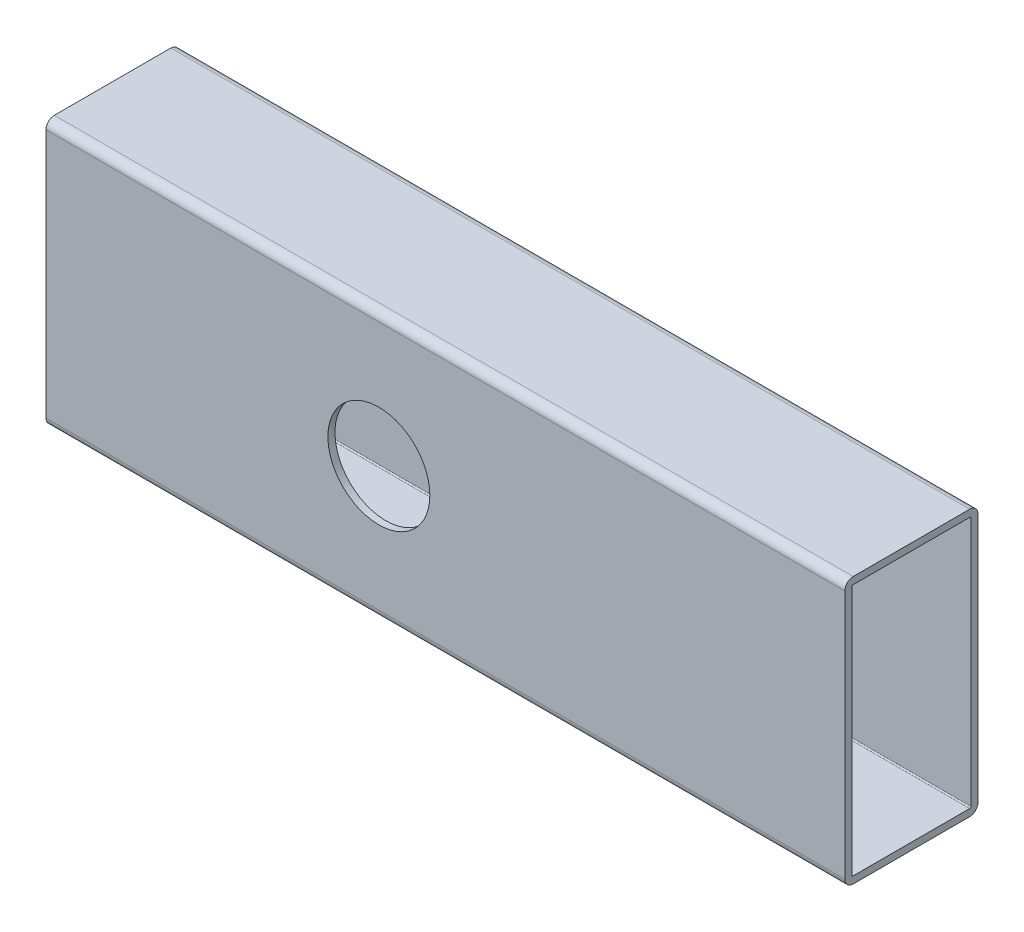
ISO-10303-21;
HEADER;
FILE_DESCRIPTION(('STEP AP214'),'2;1');
FILE_NAME('part.step','',(''),(''),'','','');
FILE_SCHEMA(('AUTOMOTIVE_DESIGN { 1 0 10303 214 1 1 1 1 }'));
ENDSEC;
DATA;
#1=APPLICATION_CONTEXT('core data for automotive mechanical design processes');
#2=APPLICATION_PROTOCOL_DEFINITION('international standard','automotive_design',2000,#1);
#3=PRODUCT_CONTEXT('',#1,'mechanical');
#4=PRODUCT('Part','Part','',(#3));
#5=PRODUCT_RELATED_PRODUCT_CATEGORY('part','',(#4));
#6=PRODUCT_DEFINITION_FORMATION('','',#4);
#7=PRODUCT_DEFINITION_CONTEXT('part definition',#1,'design');
#8=PRODUCT_DEFINITION('design','',#6,#7);
#9=PRODUCT_DEFINITION_SHAPE('','',#8);
#10=(LENGTH_UNIT() NAMED_UNIT(*) SI_UNIT(.MILLI.,.METRE.));
#11=(NAMED_UNIT(*) PLANE_ANGLE_UNIT() SI_UNIT($,.RADIAN.));
#12=(NAMED_UNIT(*) SI_UNIT($,.STERADIAN.) SOLID_ANGLE_UNIT());
#13=UNCERTAINTY_MEASURE_WITH_UNIT(LENGTH_MEASURE(1.E-05),#10,'distance_accuracy_value','');
#14=(GEOMETRIC_REPRESENTATION_CONTEXT(3) GLOBAL_UNCERTAINTY_ASSIGNED_CONTEXT((#13)) GLOBAL_UNIT_ASSIGNED_CONTEXT((#10,
#11,#12)) REPRESENTATION_CONTEXT('',''));
#15=CARTESIAN_POINT('',(0.,0.,0.));
#16=DIRECTION('',(0.,0.,1.));
#17=DIRECTION('',(1.,0.,0.));
#18=AXIS2_PLACEMENT_3D('',#15,#16,#17);
#19=CARTESIAN_POINT('',(152.4,3.65674086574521,-16.8519621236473));
#20=DIRECTION('',(-1.,0.,0.));
#21=DIRECTION('',(0.,0.,1.));
#22=AXIS2_PLACEMENT_3D('',#19,#20,#21);
#23=PLANE('',#22);
#24=CARTESIAN_POINT('',(152.4,3.65674086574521,-16.8519621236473));
#25=DIRECTION('',(1.,0.,0.));
#26=DIRECTION('',(0.,0.,1.));
#27=AXIS2_PLACEMENT_3D('',#24,#25,#26);
#28=CIRCLE('',#27,1.5875);
#29=CARTESIAN_POINT('',(152.4,3.6567408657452,-18.4394621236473));
#30=VERTEX_POINT('',#29);
#31=CARTESIAN_POINT('',(152.4,5.24424086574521,-16.8519621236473));
#32=VERTEX_POINT('',#31);
#33=EDGE_CURVE('E214',#30,#32,#28,.T.);
#34=ORIENTED_EDGE('',*,*,#33,.T.);
#35=DIRECTION('',(0.,0.,1.));
#36=VECTOR('',#35,1.);
#37=CARTESIAN_POINT('',(152.4,5.24424086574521,5.37303787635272));
#38=LINE('',#37,#36);
#39=CARTESIAN_POINT('',(152.4,5.24424086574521,5.37303787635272));
#40=VERTEX_POINT('',#39);
#41=EDGE_CURVE('E217',#32,#40,#38,.T.);
#42=ORIENTED_EDGE('',*,*,#41,.T.);
#43=CARTESIAN_POINT('',(152.4,3.65674086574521,5.37303787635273));
#44=DIRECTION('',(1.,0.,0.));
#45=DIRECTION('',(0.,0.,1.));
#46=AXIS2_PLACEMENT_3D('',#43,#44,#45);
#47=CIRCLE('',#46,1.5875);
#48=CARTESIAN_POINT('',(152.4,3.6567408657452,6.96053787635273));
#49=VERTEX_POINT('',#48);
#50=EDGE_CURVE('E220',#40,#49,#47,.T.);
#51=ORIENTED_EDGE('',*,*,#50,.T.);
#52=DIRECTION('',(0.,-1.,0.));
#53=VECTOR('',#52,1.);
#54=CARTESIAN_POINT('',(152.4,3.6567408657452,6.96053787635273));
#55=LINE('',#54,#53);
#56=CARTESIAN_POINT('',(152.4,-43.9682591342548,6.96053787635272));
#57=VERTEX_POINT('',#56);
#58=EDGE_CURVE('E222',#49,#57,#55,.T.);
#59=ORIENTED_EDGE('',*,*,#58,.T.);
#60=CARTESIAN_POINT('',(152.4,-43.9682591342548,5.37303787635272));
#61=DIRECTION('',(1.,0.,0.));
#62=DIRECTION('',(0.,0.,1.));
#63=AXIS2_PLACEMENT_3D('',#60,#61,#62);
#64=CIRCLE('',#63,1.5875);
#65=CARTESIAN_POINT('',(152.4,-45.5557591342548,5.37303787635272));
#66=VERTEX_POINT('',#65);
#67=EDGE_CURVE('E224',#57,#66,#64,.T.);
#68=ORIENTED_EDGE('',*,*,#67,.T.);
#69=DIRECTION('',(0.,0.,-1.));
#70=VECTOR('',#69,1.);
#71=CARTESIAN_POINT('',(152.4,-45.5557591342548,5.37303787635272));
#72=LINE('',#71,#70);
#73=CARTESIAN_POINT('',(152.4,-45.5557591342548,-16.8519621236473));
#74=VERTEX_POINT('',#73);
#75=EDGE_CURVE('E226',#66,#74,#72,.T.);
#76=ORIENTED_EDGE('',*,*,#75,.T.);
#77=CARTESIAN_POINT('',(152.4,-43.9682591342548,-16.8519621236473));
#78=DIRECTION('',(1.,0.,0.));
#79=DIRECTION('',(0.,0.,1.));
#80=AXIS2_PLACEMENT_3D('',#77,#78,#79);
#81=CIRCLE('',#80,1.5875);
#82=CARTESIAN_POINT('',(152.4,-43.9682591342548,-18.4394621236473));
#83=VERTEX_POINT('',#82);
#84=EDGE_CURVE('E228',#74,#83,#81,.T.);
#85=ORIENTED_EDGE('',*,*,#84,.T.);
#86=DIRECTION('',(0.,1.,0.));
#87=VECTOR('',#86,1.);
#88=CARTESIAN_POINT('',(152.4,3.6567408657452,-18.4394621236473));
#89=LINE('',#88,#87);
#90=EDGE_CURVE('E230',#83,#30,#89,.T.);
#91=ORIENTED_EDGE('',*,*,#90,.T.);
#92=EDGE_LOOP('',(#34,#42,#51,#59,#68,#76,#85,#91));
#93=FACE_BOUND('',#92,.T.);
#94=CARTESIAN_POINT('',(152.4,3.65674086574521,5.37303787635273));
#95=DIRECTION('',(1.,0.,0.));
#96=DIRECTION('',(0.,0.,1.));
#97=AXIS2_PLACEMENT_3D('',#94,#95,#96);
#98=CIRCLE('',#97,0.2413);
#99=CARTESIAN_POINT('',(152.4,3.89804086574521,5.37303787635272));
#100=VERTEX_POINT('',#99);
#101=CARTESIAN_POINT('',(152.4,3.6567408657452,5.61433787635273));
#102=VERTEX_POINT('',#101);
#103=EDGE_CURVE('E147',#100,#102,#98,.T.);
#104=ORIENTED_EDGE('',*,*,#103,.F.);
#105=DIRECTION('',(0.,0.,1.));
#106=VECTOR('',#105,1.);
#107=CARTESIAN_POINT('',(152.4,3.89804086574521,5.37303787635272));
#108=LINE('',#107,#106);
#109=CARTESIAN_POINT('',(152.4,3.89804086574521,-16.8519621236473));
#110=VERTEX_POINT('',#109);
#111=EDGE_CURVE('E181',#110,#100,#108,.T.);
#112=ORIENTED_EDGE('',*,*,#111,.F.);
#113=CARTESIAN_POINT('',(152.4,3.65674086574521,-16.8519621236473));
#114=DIRECTION('',(1.,0.,0.));
#115=DIRECTION('',(0.,0.,1.));
#116=AXIS2_PLACEMENT_3D('',#113,#114,#115);
#117=CIRCLE('',#116,0.2413);
#118=CARTESIAN_POINT('',(152.4,3.65674086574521,-17.0932621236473));
#119=VERTEX_POINT('',#118);
#120=EDGE_CURVE('E179',#119,#110,#117,.T.);
#121=ORIENTED_EDGE('',*,*,#120,.F.);
#122=DIRECTION('',(0.,1.,0.));
#123=VECTOR('',#122,1.);
#124=CARTESIAN_POINT('',(152.4,3.65674086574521,-17.0932621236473));
#125=LINE('',#124,#123);
#126=CARTESIAN_POINT('',(152.4,-43.9682591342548,-17.0932621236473));
#127=VERTEX_POINT('',#126);
#128=EDGE_CURVE('E177',#127,#119,#125,.T.);
#129=ORIENTED_EDGE('',*,*,#128,.F.);
#130=CARTESIAN_POINT('',(152.4,-43.9682591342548,-16.8519621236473));
#131=DIRECTION('',(1.,0.,0.));
#132=DIRECTION('',(0.,0.,1.));
#133=AXIS2_PLACEMENT_3D('',#130,#131,#132);
#134=CIRCLE('',#133,0.2413);
#135=CARTESIAN_POINT('',(152.4,-44.2095591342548,-16.8519621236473));
#136=VERTEX_POINT('',#135);
#137=EDGE_CURVE('E175',#136,#127,#134,.T.);
#138=ORIENTED_EDGE('',*,*,#137,.F.);
#139=DIRECTION('',(0.,0.,-1.));
#140=VECTOR('',#139,1.);
#141=CARTESIAN_POINT('',(152.4,-44.2095591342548,5.37303787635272));
#142=LINE('',#141,#140);
#143=CARTESIAN_POINT('',(152.4,-44.2095591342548,5.37303787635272));
#144=VERTEX_POINT('',#143);
#145=EDGE_CURVE('E170',#144,#136,#142,.T.);
#146=ORIENTED_EDGE('',*,*,#145,.F.);
#147=CARTESIAN_POINT('',(152.4,-43.9682591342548,5.37303787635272));
#148=DIRECTION('',(1.,0.,0.));
#149=DIRECTION('',(0.,0.,1.));
#150=AXIS2_PLACEMENT_3D('',#147,#148,#149);
#151=CIRCLE('',#150,0.2413);
#152=CARTESIAN_POINT('',(152.4,-43.9682591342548,5.61433787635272));
#153=VERTEX_POINT('',#152);
#154=EDGE_CURVE('E168',#153,#144,#151,.T.);
#155=ORIENTED_EDGE('',*,*,#154,.F.);
#156=DIRECTION('',(0.,-1.,0.));
#157=VECTOR('',#156,1.);
#158=CARTESIAN_POINT('',(152.4,3.6567408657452,5.61433787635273));
#159=LINE('',#158,#157);
#160=EDGE_CURVE('E155',#102,#153,#159,.T.);
#161=ORIENTED_EDGE('',*,*,#160,.F.);
#162=EDGE_LOOP('',(#104,#112,#121,#129,#138,#146,#155,#161));
#163=FACE_BOUND('',#162,.T.);
#164=ADVANCED_FACE('F33',(#93,#163),#23,.F.);
#165=CARTESIAN_POINT('',(0.,3.65674086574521,-16.8519621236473));
#166=DIRECTION('',(-1.,0.,0.));
#167=DIRECTION('',(0.,0.,1.));
#168=AXIS2_PLACEMENT_3D('',#165,#166,#167);
#169=PLANE('',#168);
#170=CARTESIAN_POINT('',(0.,3.65674086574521,-16.8519621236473));
#171=DIRECTION('',(1.,0.,0.));
#172=DIRECTION('',(0.,0.,1.));
#173=AXIS2_PLACEMENT_3D('',#170,#171,#172);
#174=CIRCLE('',#173,1.5875);
#175=CARTESIAN_POINT('',(0.,3.6567408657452,-18.4394621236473));
#176=VERTEX_POINT('',#175);
#177=CARTESIAN_POINT('',(0.,5.24424086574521,-16.8519621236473));
#178=VERTEX_POINT('',#177);
#179=EDGE_CURVE('E163',#176,#178,#174,.T.);
#180=ORIENTED_EDGE('',*,*,#179,.F.);
#181=DIRECTION('',(0.,1.,0.));
#182=VECTOR('',#181,1.);
#183=CARTESIAN_POINT('',(0.,3.6567408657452,-18.4394621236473));
#184=LINE('',#183,#182);
#185=CARTESIAN_POINT('',(0.,-43.9682591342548,-18.4394621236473));
#186=VERTEX_POINT('',#185);
#187=EDGE_CURVE('E218',#186,#176,#184,.T.);
#188=ORIENTED_EDGE('',*,*,#187,.F.);
#189=CARTESIAN_POINT('',(0.,-43.9682591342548,-16.8519621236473));
#190=DIRECTION('',(1.,0.,0.));
#191=DIRECTION('',(0.,0.,1.));
#192=AXIS2_PLACEMENT_3D('',#189,#190,#191);
#193=CIRCLE('',#192,1.5875);
#194=CARTESIAN_POINT('',(0.,-45.5557591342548,-16.8519621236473));
#195=VERTEX_POINT('',#194);
#196=EDGE_CURVE('E245',#195,#186,#193,.T.);
#197=ORIENTED_EDGE('',*,*,#196,.F.);
#198=DIRECTION('',(0.,0.,-1.));
#199=VECTOR('',#198,1.);
#200=CARTESIAN_POINT('',(0.,-45.5557591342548,5.37303787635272));
#201=LINE('',#200,#199);
#202=CARTESIAN_POINT('',(0.,-45.5557591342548,5.37303787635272));
#203=VERTEX_POINT('',#202);
#204=EDGE_CURVE('E243',#203,#195,#201,.T.);
#205=ORIENTED_EDGE('',*,*,#204,.F.);
#206=CARTESIAN_POINT('',(0.,-43.9682591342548,5.37303787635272));
#207=DIRECTION('',(1.,0.,0.));
#208=DIRECTION('',(0.,0.,1.));
#209=AXIS2_PLACEMENT_3D('',#206,#207,#208);
#210=CIRCLE('',#209,1.5875);
#211=CARTESIAN_POINT('',(0.,-43.9682591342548,6.96053787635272));
#212=VERTEX_POINT('',#211);
#213=EDGE_CURVE('E241',#212,#203,#210,.T.);
#214=ORIENTED_EDGE('',*,*,#213,.F.);
#215=DIRECTION('',(0.,-1.,0.));
#216=VECTOR('',#215,1.);
#217=CARTESIAN_POINT('',(0.,3.6567408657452,6.96053787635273));
#218=LINE('',#217,#216);
#219=CARTESIAN_POINT('',(0.,3.6567408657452,6.96053787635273));
#220=VERTEX_POINT('',#219);
#221=EDGE_CURVE('E239',#220,#212,#218,.T.);
#222=ORIENTED_EDGE('',*,*,#221,.F.);
#223=CARTESIAN_POINT('',(0.,3.65674086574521,5.37303787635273));
#224=DIRECTION('',(1.,0.,0.));
#225=DIRECTION('',(0.,0.,1.));
#226=AXIS2_PLACEMENT_3D('',#223,#224,#225);
#227=CIRCLE('',#226,1.5875);
#228=CARTESIAN_POINT('',(0.,5.24424086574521,5.37303787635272));
#229=VERTEX_POINT('',#228);
#230=EDGE_CURVE('E237',#229,#220,#227,.T.);
#231=ORIENTED_EDGE('',*,*,#230,.F.);
#232=DIRECTION('',(0.,0.,1.));
#233=VECTOR('',#232,1.);
#234=CARTESIAN_POINT('',(0.,5.24424086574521,5.37303787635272));
#235=LINE('',#234,#233);
#236=EDGE_CURVE('E235',#178,#229,#235,.T.);
#237=ORIENTED_EDGE('',*,*,#236,.F.);
#238=EDGE_LOOP('',(#180,#188,#197,#205,#214,#222,#231,#237));
#239=FACE_BOUND('',#238,.T.);
#240=DIRECTION('',(0.,0.,1.));
#241=VECTOR('',#240,1.);
#242=CARTESIAN_POINT('',(0.,3.89804086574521,5.37303787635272));
#243=LINE('',#242,#241);
#244=CARTESIAN_POINT('',(0.,3.89804086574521,-16.8519621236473));
#245=VERTEX_POINT('',#244);
#246=CARTESIAN_POINT('',(0.,3.89804086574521,5.37303787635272));
#247=VERTEX_POINT('',#246);
#248=EDGE_CURVE('E156',#245,#247,#243,.T.);
#249=ORIENTED_EDGE('',*,*,#248,.T.);
#250=CARTESIAN_POINT('',(0.,3.65674086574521,5.37303787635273));
#251=DIRECTION('',(1.,0.,0.));
#252=DIRECTION('',(0.,0.,1.));
#253=AXIS2_PLACEMENT_3D('',#250,#251,#252);
#254=CIRCLE('',#253,0.2413);
#255=CARTESIAN_POINT('',(0.,3.6567408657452,5.61433787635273));
#256=VERTEX_POINT('',#255);
#257=EDGE_CURVE('E57',#247,#256,#254,.T.);
#258=ORIENTED_EDGE('',*,*,#257,.T.);
#259=DIRECTION('',(0.,-1.,0.));
#260=VECTOR('',#259,1.);
#261=CARTESIAN_POINT('',(0.,3.6567408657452,5.61433787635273));
#262=LINE('',#261,#260);
#263=CARTESIAN_POINT('',(0.,-43.9682591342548,5.61433787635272));
#264=VERTEX_POINT('',#263);
#265=EDGE_CURVE('E162',#256,#264,#262,.T.);
#266=ORIENTED_EDGE('',*,*,#265,.T.);
#267=CARTESIAN_POINT('',(0.,-43.9682591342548,5.37303787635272));
#268=DIRECTION('',(1.,0.,0.));
#269=DIRECTION('',(0.,0.,1.));
#270=AXIS2_PLACEMENT_3D('',#267,#268,#269);
#271=CIRCLE('',#270,0.2413);
#272=CARTESIAN_POINT('',(0.,-44.2095591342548,5.37303787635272));
#273=VERTEX_POINT('',#272);
#274=EDGE_CURVE('E186',#264,#273,#271,.T.);
#275=ORIENTED_EDGE('',*,*,#274,.T.);
#276=DIRECTION('',(0.,0.,-1.));
#277=VECTOR('',#276,1.);
#278=CARTESIAN_POINT('',(0.,-44.2095591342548,5.37303787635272));
#279=LINE('',#278,#277);
#280=CARTESIAN_POINT('',(0.,-44.2095591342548,-16.8519621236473));
#281=VERTEX_POINT('',#280);
#282=EDGE_CURVE('E189',#273,#281,#279,.T.);
#283=ORIENTED_EDGE('',*,*,#282,.T.);
#284=CARTESIAN_POINT('',(0.,-43.9682591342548,-16.8519621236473));
#285=DIRECTION('',(1.,0.,0.));
#286=DIRECTION('',(0.,0.,1.));
#287=AXIS2_PLACEMENT_3D('',#284,#285,#286);
#288=CIRCLE('',#287,0.2413);
#289=CARTESIAN_POINT('',(0.,-43.9682591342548,-17.0932621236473));
#290=VERTEX_POINT('',#289);
#291=EDGE_CURVE('E192',#281,#290,#288,.T.);
#292=ORIENTED_EDGE('',*,*,#291,.T.);
#293=DIRECTION('',(0.,1.,0.));
#294=VECTOR('',#293,1.);
#295=CARTESIAN_POINT('',(0.,3.65674086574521,-17.0932621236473));
#296=LINE('',#295,#294);
#297=CARTESIAN_POINT('',(0.,3.65674086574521,-17.0932621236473));
#298=VERTEX_POINT('',#297);
#299=EDGE_CURVE('E195',#290,#298,#296,.T.);
#300=ORIENTED_EDGE('',*,*,#299,.T.);
#301=CARTESIAN_POINT('',(0.,3.65674086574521,-16.8519621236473));
#302=DIRECTION('',(1.,0.,0.));
#303=DIRECTION('',(0.,0.,1.));
#304=AXIS2_PLACEMENT_3D('',#301,#302,#303);
#305=CIRCLE('',#304,0.2413);
#306=EDGE_CURVE('E198',#298,#245,#305,.T.);
#307=ORIENTED_EDGE('',*,*,#306,.T.);
#308=EDGE_LOOP('',(#249,#258,#266,#275,#283,#292,#300,#307));
#309=FACE_BOUND('',#308,.T.);
#310=ADVANCED_FACE('F276',(#239,#309),#169,.T.);
#311=CARTESIAN_POINT('',(152.4,3.65674086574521,-16.8519621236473));
#312=DIRECTION('',(-1.,0.,0.));
#313=DIRECTION('',(0.,0.,1.));
#314=AXIS2_PLACEMENT_3D('',#311,#312,#313);
#315=CYLINDRICAL_SURFACE('',#314,1.5875);
#316=ORIENTED_EDGE('',*,*,#179,.T.);
#317=DIRECTION('',(-1.,0.,0.));
#318=VECTOR('',#317,1.);
#319=CARTESIAN_POINT('',(152.4,5.24424086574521,-16.8519621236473));
#320=LINE('',#319,#318);
#321=EDGE_CURVE('E11',#32,#178,#320,.T.);
#322=ORIENTED_EDGE('',*,*,#321,.F.);
#323=ORIENTED_EDGE('',*,*,#33,.F.);
#324=DIRECTION('',(-1.,0.,0.));
#325=VECTOR('',#324,1.);
#326=CARTESIAN_POINT('',(152.4,3.6567408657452,-18.4394621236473));
#327=LINE('',#326,#325);
#328=EDGE_CURVE('E232',#30,#176,#327,.T.);
#329=ORIENTED_EDGE('',*,*,#328,.T.);
#330=EDGE_LOOP('',(#316,#322,#323,#329));
#331=FACE_BOUND('',#330,.T.);
#332=ADVANCED_FACE('F35',(#331),#315,.T.);
#333=CARTESIAN_POINT('',(152.4,5.24424086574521,5.37303787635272));
#334=DIRECTION('',(0.,-1.,0.));
#335=DIRECTION('',(0.,0.,-1.));
#336=AXIS2_PLACEMENT_3D('',#333,#334,#335);
#337=PLANE('',#336);
#338=ORIENTED_EDGE('',*,*,#236,.T.);
#339=DIRECTION('',(-1.,0.,0.));
#340=VECTOR('',#339,1.);
#341=CARTESIAN_POINT('',(152.4,5.24424086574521,5.37303787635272));
#342=LINE('',#341,#340);
#343=EDGE_CURVE('E42',#40,#229,#342,.T.);
#344=ORIENTED_EDGE('',*,*,#343,.F.);
#345=ORIENTED_EDGE('',*,*,#41,.F.);
#346=ORIENTED_EDGE('',*,*,#321,.T.);
#347=EDGE_LOOP('',(#338,#344,#345,#346));
#348=FACE_BOUND('',#347,.T.);
#349=ADVANCED_FACE('F293',(#348),#337,.F.);
#350=CARTESIAN_POINT('',(152.4,3.65674086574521,5.37303787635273));
#351=DIRECTION('',(-1.,0.,0.));
#352=DIRECTION('',(0.,0.,1.));
#353=AXIS2_PLACEMENT_3D('',#350,#351,#352);
#354=CYLINDRICAL_SURFACE('',#353,1.5875);
#355=ORIENTED_EDGE('',*,*,#230,.T.);
#356=DIRECTION('',(-1.,0.,0.));
#357=VECTOR('',#356,1.);
#358=CARTESIAN_POINT('',(152.4,3.6567408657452,6.96053787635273));
#359=LINE('',#358,#357);
#360=EDGE_CURVE('E262',#49,#220,#359,.T.);
#361=ORIENTED_EDGE('',*,*,#360,.F.);
#362=ORIENTED_EDGE('',*,*,#50,.F.);
#363=ORIENTED_EDGE('',*,*,#343,.T.);
#364=EDGE_LOOP('',(#355,#361,#362,#363));
#365=FACE_BOUND('',#364,.T.);
#366=ADVANCED_FACE('F270',(#365),#354,.T.);
#367=CARTESIAN_POINT('',(152.4,3.6567408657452,6.96053787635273));
#368=DIRECTION('',(0.,0.,-1.));
#369=DIRECTION('',(0.,1.,0.));
#370=AXIS2_PLACEMENT_3D('',#367,#368,#369);
#371=PLANE('',#370);
#372=CARTESIAN_POINT('',(63.5,-20.1557591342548,6.96053787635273));
#373=DIRECTION('',(0.,0.,1.));
#374=DIRECTION('',(1.,0.,0.));
#375=AXIS2_PLACEMENT_3D('',#372,#373,#374);
#376=CIRCLE('',#375,9.7234375);
#377=CARTESIAN_POINT('',(73.2234375,-20.1557591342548,6.96053787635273));
#378=VERTEX_POINT('',#377);
#379=EDGE_CURVE('E333',#378,#378,#376,.T.);
#380=ORIENTED_EDGE('',*,*,#379,.F.);
#381=EDGE_LOOP('',(#380));
#382=FACE_BOUND('',#381,.T.);
#383=ORIENTED_EDGE('',*,*,#221,.T.);
#384=DIRECTION('',(-1.,0.,0.));
#385=VECTOR('',#384,1.);
#386=CARTESIAN_POINT('',(152.4,-43.9682591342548,6.96053787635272));
#387=LINE('',#386,#385);
#388=EDGE_CURVE('E259',#57,#212,#387,.T.);
#389=ORIENTED_EDGE('',*,*,#388,.F.);
#390=ORIENTED_EDGE('',*,*,#58,.F.);
#391=ORIENTED_EDGE('',*,*,#360,.T.);
#392=EDGE_LOOP('',(#383,#389,#390,#391));
#393=FACE_BOUND('',#392,.T.);
#394=ADVANCED_FACE('F282',(#382,#393),#371,.F.);
#395=CARTESIAN_POINT('',(152.4,-43.9682591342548,5.37303787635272));
#396=DIRECTION('',(-1.,0.,0.));
#397=DIRECTION('',(0.,0.,1.));
#398=AXIS2_PLACEMENT_3D('',#395,#396,#397);
#399=CYLINDRICAL_SURFACE('',#398,1.5875);
#400=ORIENTED_EDGE('',*,*,#213,.T.);
#401=DIRECTION('',(-1.,0.,0.));
#402=VECTOR('',#401,1.);
#403=CARTESIAN_POINT('',(152.4,-45.5557591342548,5.37303787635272));
#404=LINE('',#403,#402);
#405=EDGE_CURVE('E256',#66,#203,#404,.T.);
#406=ORIENTED_EDGE('',*,*,#405,.F.);
#407=ORIENTED_EDGE('',*,*,#67,.F.);
#408=ORIENTED_EDGE('',*,*,#388,.T.);
#409=EDGE_LOOP('',(#400,#406,#407,#408));
#410=FACE_BOUND('',#409,.T.);
#411=ADVANCED_FACE('F286',(#410),#399,.T.);
#412=CARTESIAN_POINT('',(152.4,-45.5557591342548,5.37303787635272));
#413=DIRECTION('',(0.,1.,0.));
#414=DIRECTION('',(0.,0.,1.));
#415=AXIS2_PLACEMENT_3D('',#412,#413,#414);
#416=PLANE('',#415);
#417=ORIENTED_EDGE('',*,*,#204,.T.);
#418=DIRECTION('',(-1.,0.,0.));
#419=VECTOR('',#418,1.);
#420=CARTESIAN_POINT('',(152.4,-45.5557591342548,-16.8519621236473));
#421=LINE('',#420,#419);
#422=EDGE_CURVE('E253',#74,#195,#421,.T.);
#423=ORIENTED_EDGE('',*,*,#422,.F.);
#424=ORIENTED_EDGE('',*,*,#75,.F.);
#425=ORIENTED_EDGE('',*,*,#405,.T.);
#426=EDGE_LOOP('',(#417,#423,#424,#425));
#427=FACE_BOUND('',#426,.T.);
#428=ADVANCED_FACE('F306',(#427),#416,.F.);
#429=CARTESIAN_POINT('',(152.4,-43.9682591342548,-16.8519621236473));
#430=DIRECTION('',(-1.,0.,0.));
#431=DIRECTION('',(0.,0.,1.));
#432=AXIS2_PLACEMENT_3D('',#429,#430,#431);
#433=CYLINDRICAL_SURFACE('',#432,1.5875);
#434=ORIENTED_EDGE('',*,*,#196,.T.);
#435=DIRECTION('',(-1.,0.,0.));
#436=VECTOR('',#435,1.);
#437=CARTESIAN_POINT('',(152.4,-43.9682591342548,-18.4394621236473));
#438=LINE('',#437,#436);
#439=EDGE_CURVE('E250',#83,#186,#438,.T.);
#440=ORIENTED_EDGE('',*,*,#439,.F.);
#441=ORIENTED_EDGE('',*,*,#84,.F.);
#442=ORIENTED_EDGE('',*,*,#422,.T.);
#443=EDGE_LOOP('',(#434,#440,#441,#442));
#444=FACE_BOUND('',#443,.T.);
#445=ADVANCED_FACE('F304',(#444),#433,.T.);
#446=CARTESIAN_POINT('',(152.4,3.6567408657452,-18.4394621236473));
#447=DIRECTION('',(0.,0.,1.));
#448=DIRECTION('',(0.,-1.,0.));
#449=AXIS2_PLACEMENT_3D('',#446,#447,#448);
#450=PLANE('',#449);
#451=CARTESIAN_POINT('',(63.5,-20.1557591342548,-18.4394621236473));
#452=DIRECTION('',(0.,0.,1.));
#453=DIRECTION('',(1.,0.,0.));
#454=AXIS2_PLACEMENT_3D('',#451,#452,#453);
#455=CIRCLE('',#454,9.7234375);
#456=CARTESIAN_POINT('',(73.2234375,-20.1557591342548,-18.4394621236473));
#457=VERTEX_POINT('',#456);
#458=EDGE_CURVE('E331',#457,#457,#455,.T.);
#459=ORIENTED_EDGE('',*,*,#458,.T.);
#460=EDGE_LOOP('',(#459));
#461=FACE_BOUND('',#460,.T.);
#462=ORIENTED_EDGE('',*,*,#187,.T.);
#463=ORIENTED_EDGE('',*,*,#328,.F.);
#464=ORIENTED_EDGE('',*,*,#90,.F.);
#465=ORIENTED_EDGE('',*,*,#439,.T.);
#466=EDGE_LOOP('',(#462,#463,#464,#465));
#467=FACE_BOUND('',#466,.T.);
#468=ADVANCED_FACE('F299',(#461,#467),#450,.F.);
#469=CARTESIAN_POINT('',(152.4,3.65674086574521,5.37303787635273));
#470=DIRECTION('',(-1.,0.,0.));
#471=DIRECTION('',(0.,0.,1.));
#472=AXIS2_PLACEMENT_3D('',#469,#470,#471);
#473=CYLINDRICAL_SURFACE('',#472,0.2413);
#474=ORIENTED_EDGE('',*,*,#257,.F.);
#475=DIRECTION('',(-1.,0.,0.));
#476=VECTOR('',#475,1.);
#477=CARTESIAN_POINT('',(152.4,3.89804086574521,5.37303787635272));
#478=LINE('',#477,#476);
#479=EDGE_CURVE('E151',#100,#247,#478,.T.);
#480=ORIENTED_EDGE('',*,*,#479,.F.);
#481=ORIENTED_EDGE('',*,*,#103,.T.);
#482=DIRECTION('',(-1.,0.,0.));
#483=VECTOR('',#482,1.);
#484=CARTESIAN_POINT('',(152.4,3.6567408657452,5.61433787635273));
#485=LINE('',#484,#483);
#486=EDGE_CURVE('E150',#102,#256,#485,.T.);
#487=ORIENTED_EDGE('',*,*,#486,.T.);
#488=EDGE_LOOP('',(#474,#480,#481,#487));
#489=FACE_BOUND('',#488,.T.);
#490=ADVANCED_FACE('F149',(#489),#473,.F.);
#491=CARTESIAN_POINT('',(152.4,3.6567408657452,5.61433787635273));
#492=DIRECTION('',(0.,0.,-1.));
#493=DIRECTION('',(0.,1.,0.));
#494=AXIS2_PLACEMENT_3D('',#491,#492,#493);
#495=PLANE('',#494);
#496=CARTESIAN_POINT('',(63.5,-20.1557591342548,5.61433787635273));
#497=DIRECTION('',(0.,0.,-1.));
#498=DIRECTION('',(0.,1.,0.));
#499=AXIS2_PLACEMENT_3D('',#496,#497,#498);
#500=CIRCLE('',#499,9.7234375);
#501=CARTESIAN_POINT('',(73.2234375,-20.1557591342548,5.61433787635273));
#502=VERTEX_POINT('',#501);
#503=EDGE_CURVE('E184',#502,#502,#500,.T.);
#504=ORIENTED_EDGE('',*,*,#503,.F.);
#505=EDGE_LOOP('',(#504));
#506=FACE_BOUND('',#505,.T.);
#507=ORIENTED_EDGE('',*,*,#265,.F.);
#508=ORIENTED_EDGE('',*,*,#486,.F.);
#509=ORIENTED_EDGE('',*,*,#160,.T.);
#510=DIRECTION('',(-1.,0.,0.));
#511=VECTOR('',#510,1.);
#512=CARTESIAN_POINT('',(152.4,-43.9682591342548,5.61433787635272));
#513=LINE('',#512,#511);
#514=EDGE_CURVE('E164',#153,#264,#513,.T.);
#515=ORIENTED_EDGE('',*,*,#514,.T.);
#516=EDGE_LOOP('',(#507,#508,#509,#515));
#517=FACE_BOUND('',#516,.T.);
#518=ADVANCED_FACE('F159',(#506,#517),#495,.T.);
#519=CARTESIAN_POINT('',(152.4,-43.9682591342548,5.37303787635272));
#520=DIRECTION('',(-1.,0.,0.));
#521=DIRECTION('',(0.,0.,1.));
#522=AXIS2_PLACEMENT_3D('',#519,#520,#521);
#523=CYLINDRICAL_SURFACE('',#522,0.2413);
#524=ORIENTED_EDGE('',*,*,#274,.F.);
#525=ORIENTED_EDGE('',*,*,#514,.F.);
#526=ORIENTED_EDGE('',*,*,#154,.T.);
#527=DIRECTION('',(-1.,0.,0.));
#528=VECTOR('',#527,1.);
#529=CARTESIAN_POINT('',(152.4,-44.2095591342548,5.37303787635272));
#530=LINE('',#529,#528);
#531=EDGE_CURVE('E211',#144,#273,#530,.T.);
#532=ORIENTED_EDGE('',*,*,#531,.T.);
#533=EDGE_LOOP('',(#524,#525,#526,#532));
#534=FACE_BOUND('',#533,.T.);
#535=ADVANCED_FACE('F345',(#534),#523,.F.);
#536=CARTESIAN_POINT('',(152.4,-44.2095591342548,5.37303787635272));
#537=DIRECTION('',(0.,1.,0.));
#538=DIRECTION('',(0.,0.,1.));
#539=AXIS2_PLACEMENT_3D('',#536,#537,#538);
#540=PLANE('',#539);
#541=ORIENTED_EDGE('',*,*,#282,.F.);
#542=ORIENTED_EDGE('',*,*,#531,.F.);
#543=ORIENTED_EDGE('',*,*,#145,.T.);
#544=DIRECTION('',(-1.,0.,0.));
#545=VECTOR('',#544,1.);
#546=CARTESIAN_POINT('',(152.4,-44.2095591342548,-16.8519621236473));
#547=LINE('',#546,#545);
#548=EDGE_CURVE('E209',#136,#281,#547,.T.);
#549=ORIENTED_EDGE('',*,*,#548,.T.);
#550=EDGE_LOOP('',(#541,#542,#543,#549));
#551=FACE_BOUND('',#550,.T.);
#552=ADVANCED_FACE('F349',(#551),#540,.T.);
#553=CARTESIAN_POINT('',(152.4,-43.9682591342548,-16.8519621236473));
#554=DIRECTION('',(-1.,0.,0.));
#555=DIRECTION('',(0.,0.,1.));
#556=AXIS2_PLACEMENT_3D('',#553,#554,#555);
#557=CYLINDRICAL_SURFACE('',#556,0.2413);
#558=ORIENTED_EDGE('',*,*,#291,.F.);
#559=ORIENTED_EDGE('',*,*,#548,.F.);
#560=ORIENTED_EDGE('',*,*,#137,.T.);
#561=DIRECTION('',(-1.,0.,0.));
#562=VECTOR('',#561,1.);
#563=CARTESIAN_POINT('',(152.4,-43.9682591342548,-17.0932621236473));
#564=LINE('',#563,#562);
#565=EDGE_CURVE('E207',#127,#290,#564,.T.);
#566=ORIENTED_EDGE('',*,*,#565,.T.);
#567=EDGE_LOOP('',(#558,#559,#560,#566));
#568=FACE_BOUND('',#567,.T.);
#569=ADVANCED_FACE('F355',(#568),#557,.F.);
#570=CARTESIAN_POINT('',(152.4,3.65674086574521,-17.0932621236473));
#571=DIRECTION('',(0.,0.,1.));
#572=DIRECTION('',(0.,-1.,0.));
#573=AXIS2_PLACEMENT_3D('',#570,#571,#572);
#574=PLANE('',#573);
#575=CARTESIAN_POINT('',(63.5,-20.1557591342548,-17.0932621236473));
#576=DIRECTION('',(0.,0.,1.));
#577=DIRECTION('',(0.,-1.,0.));
#578=AXIS2_PLACEMENT_3D('',#575,#576,#577);
#579=CIRCLE('',#578,9.7234375);
#580=CARTESIAN_POINT('',(73.2234375,-20.1557591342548,-17.0932621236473));
#581=VERTEX_POINT('',#580);
#582=EDGE_CURVE('E37',#581,#581,#579,.T.);
#583=ORIENTED_EDGE('',*,*,#582,.F.);
#584=EDGE_LOOP('',(#583));
#585=FACE_BOUND('',#584,.T.);
#586=ORIENTED_EDGE('',*,*,#299,.F.);
#587=ORIENTED_EDGE('',*,*,#565,.F.);
#588=ORIENTED_EDGE('',*,*,#128,.T.);
#589=DIRECTION('',(-1.,0.,0.));
#590=VECTOR('',#589,1.);
#591=CARTESIAN_POINT('',(152.4,3.65674086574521,-17.0932621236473));
#592=LINE('',#591,#590);
#593=EDGE_CURVE('E205',#119,#298,#592,.T.);
#594=ORIENTED_EDGE('',*,*,#593,.T.);
#595=EDGE_LOOP('',(#586,#587,#588,#594));
#596=FACE_BOUND('',#595,.T.);
#597=ADVANCED_FACE('F359',(#585,#596),#574,.T.);
#598=CARTESIAN_POINT('',(152.4,3.65674086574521,-16.8519621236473));
#599=DIRECTION('',(-1.,0.,0.));
#600=DIRECTION('',(0.,0.,1.));
#601=AXIS2_PLACEMENT_3D('',#598,#599,#600);
#602=CYLINDRICAL_SURFACE('',#601,0.2413);
#603=ORIENTED_EDGE('',*,*,#306,.F.);
#604=ORIENTED_EDGE('',*,*,#593,.F.);
#605=ORIENTED_EDGE('',*,*,#120,.T.);
#606=DIRECTION('',(-1.,0.,0.));
#607=VECTOR('',#606,1.);
#608=CARTESIAN_POINT('',(152.4,3.89804086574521,-16.8519621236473));
#609=LINE('',#608,#607);
#610=EDGE_CURVE('E49',#110,#245,#609,.T.);
#611=ORIENTED_EDGE('',*,*,#610,.T.);
#612=EDGE_LOOP('',(#603,#604,#605,#611));
#613=FACE_BOUND('',#612,.T.);
#614=ADVANCED_FACE('F363',(#613),#602,.F.);
#615=CARTESIAN_POINT('',(152.4,3.89804086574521,5.37303787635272));
#616=DIRECTION('',(0.,-1.,0.));
#617=DIRECTION('',(0.,0.,-1.));
#618=AXIS2_PLACEMENT_3D('',#615,#616,#617);
#619=PLANE('',#618);
#620=ORIENTED_EDGE('',*,*,#248,.F.);
#621=ORIENTED_EDGE('',*,*,#610,.F.);
#622=ORIENTED_EDGE('',*,*,#111,.T.);
#623=ORIENTED_EDGE('',*,*,#479,.T.);
#624=EDGE_LOOP('',(#620,#621,#622,#623));
#625=FACE_BOUND('',#624,.T.);
#626=ADVANCED_FACE('F367',(#625),#619,.T.);
#627=CARTESIAN_POINT('',(63.5,-20.1557591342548,-18.4394621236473));
#628=DIRECTION('',(0.,0.,1.));
#629=DIRECTION('',(1.,0.,0.));
#630=AXIS2_PLACEMENT_3D('',#627,#628,#629);
#631=CYLINDRICAL_SURFACE('',#630,9.7234375);
#632=CARTESIAN_POINT('',(73.2234375,-20.1557591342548,-17.0932621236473));
#633=CARTESIAN_POINT('',(73.2234375,-20.1557591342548,-17.1072850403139));
#634=CARTESIAN_POINT('',(73.2234375,-20.1557591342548,-17.1213079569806));
#635=CARTESIAN_POINT('',(73.2234375,-20.1557591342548,-17.1493537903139));
#636=CARTESIAN_POINT('',(73.2234375,-20.1557591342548,-17.1633767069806));
#637=CARTESIAN_POINT('',(73.2234375,-20.1557591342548,-17.1914225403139));
#638=CARTESIAN_POINT('',(73.2234375,-20.1557591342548,-17.2054454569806));
#639=CARTESIAN_POINT('',(73.2234375,-20.1557591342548,-17.2334912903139));
#640=CARTESIAN_POINT('',(73.2234375,-20.1557591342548,-17.2475142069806));
#641=CARTESIAN_POINT('',(73.2234375,-20.1557591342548,-17.2755600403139));
#642=CARTESIAN_POINT('',(73.2234375,-20.1557591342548,-17.2895829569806));
#643=CARTESIAN_POINT('',(73.2234375,-20.1557591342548,-17.3176287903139));
#644=CARTESIAN_POINT('',(73.2234375,-20.1557591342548,-17.3316517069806));
#645=CARTESIAN_POINT('',(73.2234375,-20.1557591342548,-17.3596975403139));
#646=CARTESIAN_POINT('',(73.2234375,-20.1557591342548,-17.3737204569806));
#647=CARTESIAN_POINT('',(73.2234375,-20.1557591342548,-17.4017662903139));
#648=CARTESIAN_POINT('',(73.2234375,-20.1557591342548,-17.4157892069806));
#649=CARTESIAN_POINT('',(73.2234375,-20.1557591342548,-17.4438350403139));
#650=CARTESIAN_POINT('',(73.2234375,-20.1557591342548,-17.4578579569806));
#651=CARTESIAN_POINT('',(73.2234375,-20.1557591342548,-17.4859037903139));
#652=CARTESIAN_POINT('',(73.2234375,-20.1557591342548,-17.4999267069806));
#653=CARTESIAN_POINT('',(73.2234375,-20.1557591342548,-17.5279725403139));
#654=CARTESIAN_POINT('',(73.2234375,-20.1557591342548,-17.5419954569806));
#655=CARTESIAN_POINT('',(73.2234375,-20.1557591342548,-17.5700412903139));
#656=CARTESIAN_POINT('',(73.2234375,-20.1557591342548,-17.5840642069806));
#657=CARTESIAN_POINT('',(73.2234375,-20.1557591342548,-17.6121100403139));
#658=CARTESIAN_POINT('',(73.2234375,-20.1557591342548,-17.6261329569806));
#659=CARTESIAN_POINT('',(73.2234375,-20.1557591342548,-17.6541787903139));
#660=CARTESIAN_POINT('',(73.2234375,-20.1557591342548,-17.6682017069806));
#661=CARTESIAN_POINT('',(73.2234375,-20.1557591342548,-17.6962475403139));
#662=CARTESIAN_POINT('',(73.2234375,-20.1557591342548,-17.7102704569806));
#663=CARTESIAN_POINT('',(73.2234375,-20.1557591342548,-17.7383162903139));
#664=CARTESIAN_POINT('',(73.2234375,-20.1557591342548,-17.7523392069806));
#665=CARTESIAN_POINT('',(73.2234375,-20.1557591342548,-17.7803850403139));
#666=CARTESIAN_POINT('',(73.2234375,-20.1557591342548,-17.7944079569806));
#667=CARTESIAN_POINT('',(73.2234375,-20.1557591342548,-17.8224537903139));
#668=CARTESIAN_POINT('',(73.2234375,-20.1557591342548,-17.8364767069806));
#669=CARTESIAN_POINT('',(73.2234375,-20.1557591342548,-17.8645225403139));
#670=CARTESIAN_POINT('',(73.2234375,-20.1557591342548,-17.8785454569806));
#671=CARTESIAN_POINT('',(73.2234375,-20.1557591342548,-17.9065912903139));
#672=CARTESIAN_POINT('',(73.2234375,-20.1557591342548,-17.9206142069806));
#673=CARTESIAN_POINT('',(73.2234375,-20.1557591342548,-17.9486600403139));
#674=CARTESIAN_POINT('',(73.2234375,-20.1557591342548,-17.9626829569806));
#675=CARTESIAN_POINT('',(73.2234375,-20.1557591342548,-17.9907287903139));
#676=CARTESIAN_POINT('',(73.2234375,-20.1557591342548,-18.0047517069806));
#677=CARTESIAN_POINT('',(73.2234375,-20.1557591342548,-18.0327975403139));
#678=CARTESIAN_POINT('',(73.2234375,-20.1557591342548,-18.0468204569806));
#679=CARTESIAN_POINT('',(73.2234375,-20.1557591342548,-18.0748662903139));
#680=CARTESIAN_POINT('',(73.2234375,-20.1557591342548,-18.0888892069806));
#681=CARTESIAN_POINT('',(73.2234375,-20.1557591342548,-18.1169350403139));
#682=CARTESIAN_POINT('',(73.2234375,-20.1557591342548,-18.1309579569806));
#683=CARTESIAN_POINT('',(73.2234375,-20.1557591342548,-18.1590037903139));
#684=CARTESIAN_POINT('',(73.2234375,-20.1557591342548,-18.1730267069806));
#685=CARTESIAN_POINT('',(73.2234375,-20.1557591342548,-18.2010725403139));
#686=CARTESIAN_POINT('',(73.2234375,-20.1557591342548,-18.2150954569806));
#687=CARTESIAN_POINT('',(73.2234375,-20.1557591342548,-18.2431412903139));
#688=CARTESIAN_POINT('',(73.2234375,-20.1557591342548,-18.2571642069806));
#689=CARTESIAN_POINT('',(73.2234375,-20.1557591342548,-18.2852100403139));
#690=CARTESIAN_POINT('',(73.2234375,-20.1557591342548,-18.2992329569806));
#691=CARTESIAN_POINT('',(73.2234375,-20.1557591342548,-18.3272787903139));
#692=CARTESIAN_POINT('',(73.2234375,-20.1557591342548,-18.3413017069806));
#693=CARTESIAN_POINT('',(73.2234375,-20.1557591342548,-18.3693475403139));
#694=CARTESIAN_POINT('',(73.2234375,-20.1557591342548,-18.3833704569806));
#695=CARTESIAN_POINT('',(73.2234375,-20.1557591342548,-18.4114162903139));
#696=CARTESIAN_POINT('',(73.2234375,-20.1557591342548,-18.4254392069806));
#697=CARTESIAN_POINT('',(73.2234375,-20.1557591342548,-18.4394621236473));
#698=B_SPLINE_CURVE_WITH_KNOTS('',3,(#632,#633,#634,#635,#636,#637,#638,#639,#640,#641,#642,
#643,#644,#645,#646,#647,#648,#649,#650,#651,#652,#653,#654,#655,#656,#657,#658,#659,#660,#661,
#662,#663,#664,#665,#666,#667,#668,#669,#670,#671,#672,#673,#674,#675,#676,#677,#678,#679,#680,
#681,#682,#683,#684,#685,#686,#687,#688,#689,#690,#691,#692,#693,#694,#695,#696,#697),
.UNSPECIFIED.,.F.,.F.,(4,2,2,2,2,2,2,2,2,2,2,2,2,2,2,2,2,2,2,2,2,2,2,2,2,2,2,2,2,2,2,2,4),(0.,
0.0420687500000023,0.0841375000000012,0.12620625,0.168275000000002,0.210343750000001,
0.252412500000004,0.294481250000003,0.336550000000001,0.378618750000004,0.420687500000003,
0.462756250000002,0.504825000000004,0.546893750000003,0.588962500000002,0.631031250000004,
0.673100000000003,0.715168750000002,0.757237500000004,0.799306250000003,0.841375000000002,
0.883443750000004,0.925512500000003,0.967581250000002,1.00965,1.05171875,1.0937875,1.13585625,
1.177925,1.21999375,1.2620625,1.30413125,1.3462),.UNSPECIFIED.);
#699=EDGE_CURVE('BSEAM371',#581,#457,#698,.T.);
#700=ORIENTED_EDGE('',*,*,#582,.T.);
#701=ORIENTED_EDGE('',*,*,#458,.F.);
#702=ORIENTED_EDGE('',*,*,#699,.T.);
#703=ORIENTED_EDGE('',*,*,#699,.F.);
#704=EDGE_LOOP('',(#700,#702,#701,#703));
#705=FACE_BOUND('',#704,.T.);
#706=ADVANCED_FACE('F371',(#705),#631,.F.);
#707=CARTESIAN_POINT('',(73.2234375,-20.1557591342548,5.61433787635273));
#708=CARTESIAN_POINT('',(73.2234375,-20.1557591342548,5.62836079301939));
#709=CARTESIAN_POINT('',(73.2234375,-20.1557591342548,5.64238370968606));
#710=CARTESIAN_POINT('',(73.2234375,-20.1557591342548,5.67042954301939));
#711=CARTESIAN_POINT('',(73.2234375,-20.1557591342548,5.68445245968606));
#712=CARTESIAN_POINT('',(73.2234375,-20.1557591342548,5.71249829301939));
#713=CARTESIAN_POINT('',(73.2234375,-20.1557591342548,5.72652120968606));
#714=CARTESIAN_POINT('',(73.2234375,-20.1557591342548,5.75456704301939));
#715=CARTESIAN_POINT('',(73.2234375,-20.1557591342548,5.76858995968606));
#716=CARTESIAN_POINT('',(73.2234375,-20.1557591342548,5.79663579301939));
#717=CARTESIAN_POINT('',(73.2234375,-20.1557591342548,5.81065870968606));
#718=CARTESIAN_POINT('',(73.2234375,-20.1557591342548,5.83870454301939));
#719=CARTESIAN_POINT('',(73.2234375,-20.1557591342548,5.85272745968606));
#720=CARTESIAN_POINT('',(73.2234375,-20.1557591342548,5.88077329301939));
#721=CARTESIAN_POINT('',(73.2234375,-20.1557591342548,5.89479620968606));
#722=CARTESIAN_POINT('',(73.2234375,-20.1557591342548,5.92284204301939));
#723=CARTESIAN_POINT('',(73.2234375,-20.1557591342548,5.93686495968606));
#724=CARTESIAN_POINT('',(73.2234375,-20.1557591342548,5.96491079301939));
#725=CARTESIAN_POINT('',(73.2234375,-20.1557591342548,5.97893370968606));
#726=CARTESIAN_POINT('',(73.2234375,-20.1557591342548,6.00697954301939));
#727=CARTESIAN_POINT('',(73.2234375,-20.1557591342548,6.02100245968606));
#728=CARTESIAN_POINT('',(73.2234375,-20.1557591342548,6.04904829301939));
#729=CARTESIAN_POINT('',(73.2234375,-20.1557591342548,6.06307120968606));
#730=CARTESIAN_POINT('',(73.2234375,-20.1557591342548,6.09111704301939));
#731=CARTESIAN_POINT('',(73.2234375,-20.1557591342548,6.10513995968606));
#732=CARTESIAN_POINT('',(73.2234375,-20.1557591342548,6.13318579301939));
#733=CARTESIAN_POINT('',(73.2234375,-20.1557591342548,6.14720870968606));
#734=CARTESIAN_POINT('',(73.2234375,-20.1557591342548,6.17525454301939));
#735=CARTESIAN_POINT('',(73.2234375,-20.1557591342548,6.18927745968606));
#736=CARTESIAN_POINT('',(73.2234375,-20.1557591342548,6.21732329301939));
#737=CARTESIAN_POINT('',(73.2234375,-20.1557591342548,6.23134620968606));
#738=CARTESIAN_POINT('',(73.2234375,-20.1557591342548,6.25939204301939));
#739=CARTESIAN_POINT('',(73.2234375,-20.1557591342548,6.27341495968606));
#740=CARTESIAN_POINT('',(73.2234375,-20.1557591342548,6.30146079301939));
#741=CARTESIAN_POINT('',(73.2234375,-20.1557591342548,6.31548370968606));
#742=CARTESIAN_POINT('',(73.2234375,-20.1557591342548,6.34352954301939));
#743=CARTESIAN_POINT('',(73.2234375,-20.1557591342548,6.35755245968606));
#744=CARTESIAN_POINT('',(73.2234375,-20.1557591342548,6.38559829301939));
#745=CARTESIAN_POINT('',(73.2234375,-20.1557591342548,6.39962120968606));
#746=CARTESIAN_POINT('',(73.2234375,-20.1557591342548,6.42766704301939));
#747=CARTESIAN_POINT('',(73.2234375,-20.1557591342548,6.44168995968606));
#748=CARTESIAN_POINT('',(73.2234375,-20.1557591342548,6.46973579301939));
#749=CARTESIAN_POINT('',(73.2234375,-20.1557591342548,6.48375870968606));
#750=CARTESIAN_POINT('',(73.2234375,-20.1557591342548,6.51180454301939));
#751=CARTESIAN_POINT('',(73.2234375,-20.1557591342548,6.52582745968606));
#752=CARTESIAN_POINT('',(73.2234375,-20.1557591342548,6.55387329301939));
#753=CARTESIAN_POINT('',(73.2234375,-20.1557591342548,6.56789620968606));
#754=CARTESIAN_POINT('',(73.2234375,-20.1557591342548,6.59594204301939));
#755=CARTESIAN_POINT('',(73.2234375,-20.1557591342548,6.60996495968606));
#756=CARTESIAN_POINT('',(73.2234375,-20.1557591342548,6.63801079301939));
#757=CARTESIAN_POINT('',(73.2234375,-20.1557591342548,6.65203370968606));
#758=CARTESIAN_POINT('',(73.2234375,-20.1557591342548,6.68007954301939));
#759=CARTESIAN_POINT('',(73.2234375,-20.1557591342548,6.69410245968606));
#760=CARTESIAN_POINT('',(73.2234375,-20.1557591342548,6.72214829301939));
#761=CARTESIAN_POINT('',(73.2234375,-20.1557591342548,6.73617120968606));
#762=CARTESIAN_POINT('',(73.2234375,-20.1557591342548,6.76421704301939));
#763=CARTESIAN_POINT('',(73.2234375,-20.1557591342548,6.77823995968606));
#764=CARTESIAN_POINT('',(73.2234375,-20.1557591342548,6.80628579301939));
#765=CARTESIAN_POINT('',(73.2234375,-20.1557591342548,6.82030870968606));
#766=CARTESIAN_POINT('',(73.2234375,-20.1557591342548,6.84835454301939));
#767=CARTESIAN_POINT('',(73.2234375,-20.1557591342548,6.86237745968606));
#768=CARTESIAN_POINT('',(73.2234375,-20.1557591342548,6.89042329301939));
#769=CARTESIAN_POINT('',(73.2234375,-20.1557591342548,6.90444620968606));
#770=CARTESIAN_POINT('',(73.2234375,-20.1557591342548,6.93249204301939));
#771=CARTESIAN_POINT('',(73.2234375,-20.1557591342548,6.94651495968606));
#772=CARTESIAN_POINT('',(73.2234375,-20.1557591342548,6.96053787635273));
#773=B_SPLINE_CURVE_WITH_KNOTS('',3,(#707,#708,#709,#710,#711,#712,#713,#714,#715,#716,#717,
#718,#719,#720,#721,#722,#723,#724,#725,#726,#727,#728,#729,#730,#731,#732,#733,#734,#735,#736,
#737,#738,#739,#740,#741,#742,#743,#744,#745,#746,#747,#748,#749,#750,#751,#752,#753,#754,#755,
#756,#757,#758,#759,#760,#761,#762,#763,#764,#765,#766,#767,#768,#769,#770,#771,#772),
.UNSPECIFIED.,.F.,.F.,(4,2,2,2,2,2,2,2,2,2,2,2,2,2,2,2,2,2,2,2,2,2,2,2,2,2,2,2,2,2,2,2,4),(0.,
0.0420687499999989,0.0841375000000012,0.12620625,0.168274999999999,0.210343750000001,0.2524125,
0.294481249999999,0.336549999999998,0.37861875,0.420687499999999,0.462756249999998,0.504825,
0.546893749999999,0.588962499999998,0.63103125,0.673099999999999,0.715168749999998,
0.757237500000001,0.799306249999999,0.841374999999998,0.883443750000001,0.9255125,
0.967581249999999,1.00965,1.05171875,1.0937875,1.13585625,1.177925,1.21999375,1.2620625,
1.30413125,1.3462),.UNSPECIFIED.);
#774=EDGE_CURVE('BSEAM341',#502,#378,#773,.T.);
#775=ORIENTED_EDGE('',*,*,#503,.T.);
#776=ORIENTED_EDGE('',*,*,#379,.T.);
#777=ORIENTED_EDGE('',*,*,#774,.T.);
#778=ORIENTED_EDGE('',*,*,#774,.F.);
#779=EDGE_LOOP('',(#775,#777,#776,#778));
#780=FACE_BOUND('',#779,.T.);
#781=ADVANCED_FACE('F341',(#780),#631,.F.);
#782=CLOSED_SHELL('',(#164,#310,#332,#349,#366,#394,#411,#428,#445,#468,#490,#518,#535,#552,
#569,#597,#614,#626,#706,#781));
#783=MANIFOLD_SOLID_BREP('B2',#782);
#784=ADVANCED_BREP_SHAPE_REPRESENTATION('',(#18,#783),#14);
#785=SHAPE_DEFINITION_REPRESENTATION(#9,#784);
ENDSEC;
END-ISO-10303-21;
